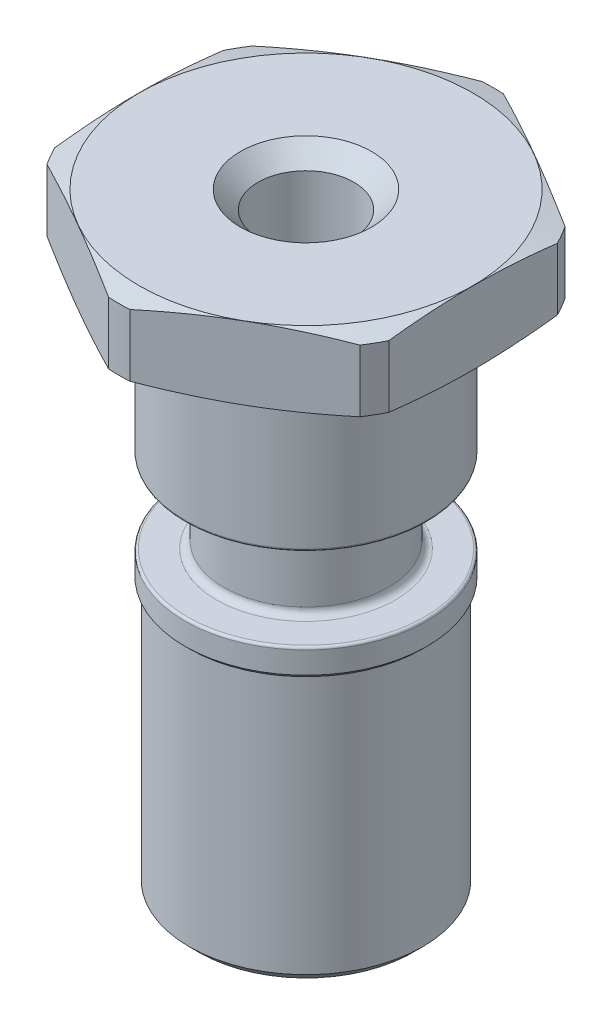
ISO-10303-21;
HEADER;
FILE_DESCRIPTION(('STEP AP214'),'2;1');
FILE_NAME('part.step','',(''),(''),'','','');
FILE_SCHEMA(('AUTOMOTIVE_DESIGN { 1 0 10303 214 1 1 1 1 }'));
ENDSEC;
DATA;
#1=APPLICATION_CONTEXT('core data for automotive mechanical design processes');
#2=APPLICATION_PROTOCOL_DEFINITION('international standard','automotive_design',2000,#1);
#3=PRODUCT_CONTEXT('',#1,'mechanical');
#4=PRODUCT('Part','Part','',(#3));
#5=PRODUCT_RELATED_PRODUCT_CATEGORY('part','',(#4));
#6=PRODUCT_DEFINITION_FORMATION('','',#4);
#7=PRODUCT_DEFINITION_CONTEXT('part definition',#1,'design');
#8=PRODUCT_DEFINITION('design','',#6,#7);
#9=PRODUCT_DEFINITION_SHAPE('','',#8);
#10=(LENGTH_UNIT() NAMED_UNIT(*) SI_UNIT(.MILLI.,.METRE.));
#11=(NAMED_UNIT(*) PLANE_ANGLE_UNIT() SI_UNIT($,.RADIAN.));
#12=(NAMED_UNIT(*) SI_UNIT($,.STERADIAN.) SOLID_ANGLE_UNIT());
#13=UNCERTAINTY_MEASURE_WITH_UNIT(LENGTH_MEASURE(1.E-05),#10,'distance_accuracy_value','');
#14=(GEOMETRIC_REPRESENTATION_CONTEXT(3) GLOBAL_UNCERTAINTY_ASSIGNED_CONTEXT((#13)) GLOBAL_UNIT_ASSIGNED_CONTEXT((#10,
#11,#12)) REPRESENTATION_CONTEXT('',''));
#15=CARTESIAN_POINT('',(0.,0.,0.));
#16=DIRECTION('',(0.,0.,1.));
#17=DIRECTION('',(1.,0.,0.));
#18=AXIS2_PLACEMENT_3D('',#15,#16,#17);
#19=CARTESIAN_POINT('',(0.,37.19,0.));
#20=DIRECTION('',(0.,1.,0.));
#21=DIRECTION('',(0.,0.,1.));
#22=AXIS2_PLACEMENT_3D('',#19,#20,#21);
#23=CONICAL_SURFACE('',#22,8.7249,1.30899693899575);
#24=CARTESIAN_POINT('',(0.,37.19,0.));
#25=DIRECTION('',(0.,1.,0.));
#26=DIRECTION('',(0.,0.,1.));
#27=AXIS2_PLACEMENT_3D('',#24,#25,#26);
#28=CIRCLE('',#27,8.7249);
#29=CARTESIAN_POINT('',(0.,37.19,8.7249));
#30=VERTEX_POINT('',#29);
#31=EDGE_CURVE('E320',#30,#30,#28,.T.);
#32=ORIENTED_EDGE('',*,*,#31,.T.);
#33=EDGE_LOOP('',(#32));
#34=FACE_BOUND('',#33,.T.);
#35=CARTESIAN_POINT('',(0.550322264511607,37.4726452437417,9.76425036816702));
#36=CARTESIAN_POINT('',(0.867378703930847,37.4284271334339,9.58119774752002));
#37=CARTESIAN_POINT('',(1.18492607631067,37.3885797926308,9.39786168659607));
#38=CARTESIAN_POINT('',(1.82092136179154,37.3189242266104,9.03066963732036));
#39=CARTESIAN_POINT('',(2.13936948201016,37.2891185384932,8.84681352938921));
#40=CARTESIAN_POINT('',(2.7756278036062,37.2409656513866,8.47946961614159));
#41=CARTESIAN_POINT('',(3.0934353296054,37.222572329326,8.29598335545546));
#42=CARTESIAN_POINT('',(3.72937026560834,37.1979409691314,7.92882614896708));
#43=CARTESIAN_POINT('',(4.04749763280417,37.1917014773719,7.74515522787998));
#44=CARTESIAN_POINT('',(4.68375236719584,37.1917014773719,7.37781338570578));
#45=CARTESIAN_POINT('',(5.00187973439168,37.1979409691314,7.19414246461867));
#46=CARTESIAN_POINT('',(5.63781467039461,37.222572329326,6.82698525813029));
#47=CARTESIAN_POINT('',(5.95562219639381,37.2409656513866,6.64349899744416));
#48=CARTESIAN_POINT('',(6.59188051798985,37.2891185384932,6.27615508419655));
#49=CARTESIAN_POINT('',(6.91032863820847,37.3189242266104,6.0922989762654));
#50=CARTESIAN_POINT('',(7.54632392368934,37.3885797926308,5.72510692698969));
#51=CARTESIAN_POINT('',(7.86387129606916,37.4284271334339,5.54177086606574));
#52=CARTESIAN_POINT('',(8.1809277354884,37.4726452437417,5.35871824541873));
#53=B_SPLINE_CURVE_WITH_KNOTS('',3,(#35,#36,#37,#38,#39,#40,#41,#42,#43,#44,#45,#46,#47,#48,#49,
#50,#51,#52),.UNSPECIFIED.,.F.,.F.,(4,2,2,2,2,2,2,2,4),(0.,1.10632965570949,2.21293862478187,
3.31504559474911,4.41702074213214,5.51899588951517,6.6211028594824,7.72771182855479,
8.83404148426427),.UNSPECIFIED.);
#54=CARTESIAN_POINT('',(0.551757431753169,37.4724452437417,9.76342177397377));
#55=VERTEX_POINT('',#54);
#56=CARTESIAN_POINT('',(8.17949256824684,37.4724452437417,5.35954683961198));
#57=VERTEX_POINT('',#56);
#58=EDGE_CURVE('E207',#55,#57,#53,.T.);
#59=ORIENTED_EDGE('',*,*,#58,.F.);
#60=CARTESIAN_POINT('',(0.,37.4724452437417,0.));
#61=DIRECTION('',(0.,1.,0.));
#62=DIRECTION('',(0.,0.,1.));
#63=AXIS2_PLACEMENT_3D('',#60,#61,#62);
#64=CIRCLE('',#63,9.779);
#65=CARTESIAN_POINT('',(-0.551757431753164,37.4724452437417,9.76342177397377));
#66=VERTEX_POINT('',#65);
#67=EDGE_CURVE('E162',#66,#55,#64,.T.);
#68=ORIENTED_EDGE('',*,*,#67,.F.);
#69=CARTESIAN_POINT('',(-8.1809277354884,37.4726452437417,5.35871824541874));
#70=CARTESIAN_POINT('',(-7.86387129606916,37.4284271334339,5.54177086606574));
#71=CARTESIAN_POINT('',(-7.54632392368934,37.3885797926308,5.72510692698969));
#72=CARTESIAN_POINT('',(-6.91032863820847,37.3189242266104,6.0922989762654));
#73=CARTESIAN_POINT('',(-6.59188051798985,37.2891185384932,6.27615508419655));
#74=CARTESIAN_POINT('',(-5.95562219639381,37.2409656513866,6.64349899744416));
#75=CARTESIAN_POINT('',(-5.63781467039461,37.222572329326,6.82698525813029));
#76=CARTESIAN_POINT('',(-5.00187973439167,37.1979409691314,7.19414246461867));
#77=CARTESIAN_POINT('',(-4.68375236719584,37.1917014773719,7.37781338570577));
#78=CARTESIAN_POINT('',(-4.04749763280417,37.1917014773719,7.74515522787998));
#79=CARTESIAN_POINT('',(-3.72937026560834,37.1979409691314,7.92882614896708));
#80=CARTESIAN_POINT('',(-3.0934353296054,37.222572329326,8.29598335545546));
#81=CARTESIAN_POINT('',(-2.7756278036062,37.2409656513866,8.47946961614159));
#82=CARTESIAN_POINT('',(-2.13936948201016,37.2891185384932,8.8468135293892));
#83=CARTESIAN_POINT('',(-1.82092136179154,37.3189242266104,9.03066963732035));
#84=CARTESIAN_POINT('',(-1.18492607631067,37.3885797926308,9.39786168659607));
#85=CARTESIAN_POINT('',(-0.867378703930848,37.4284271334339,9.58119774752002));
#86=CARTESIAN_POINT('',(-0.550322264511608,37.4726452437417,9.76425036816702));
#87=B_SPLINE_CURVE_WITH_KNOTS('',3,(#69,#70,#71,#72,#73,#74,#75,#76,#77,#78,#79,#80,#81,#82,#83,
#84,#85,#86),.UNSPECIFIED.,.F.,.F.,(4,2,2,2,2,2,2,2,4),(0.,1.10632965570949,2.21293862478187,
3.3150455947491,4.41702074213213,5.51899588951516,6.62110285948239,7.72771182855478,
8.83404148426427),.UNSPECIFIED.);
#88=CARTESIAN_POINT('',(-8.17949256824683,37.4724452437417,5.35954683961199));
#89=VERTEX_POINT('',#88);
#90=EDGE_CURVE('E307',#89,#66,#87,.T.);
#91=ORIENTED_EDGE('',*,*,#90,.F.);
#92=CARTESIAN_POINT('',(-8.73125,37.4724452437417,4.40387493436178));
#93=VERTEX_POINT('',#92);
#94=EDGE_CURVE('E167',#93,#89,#64,.T.);
#95=ORIENTED_EDGE('',*,*,#94,.F.);
#96=CARTESIAN_POINT('',(-8.73125,39.1200704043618,-13.3216785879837));
#97=CARTESIAN_POINT('',(-8.73125,39.031358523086,-12.9257205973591));
#98=CARTESIAN_POINT('',(-8.73125,38.9437338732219,-12.5295145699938));
#99=CARTESIAN_POINT('',(-8.73125,38.7712458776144,-11.7364846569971));
#100=CARTESIAN_POINT('',(-8.73125,38.6863826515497,-11.3396607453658));
#101=CARTESIAN_POINT('',(-8.73125,38.5199301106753,-10.5449159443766));
#102=CARTESIAN_POINT('',(-8.73125,38.4383441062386,-10.1469943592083));
#103=CARTESIAN_POINT('',(-8.73125,38.2793288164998,-9.35032196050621));
#104=CARTESIAN_POINT('',(-8.73125,38.2018994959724,-8.95157115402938));
#105=CARTESIAN_POINT('',(-8.73125,38.0527847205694,-8.15628119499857));
#106=CARTESIAN_POINT('',(-8.73125,37.9810584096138,-7.75974974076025));
#107=CARTESIAN_POINT('',(-8.73125,37.8438827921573,-6.96560446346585));
#108=CARTESIAN_POINT('',(-8.73125,37.7784333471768,-6.56799066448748));
#109=CARTESIAN_POINT('',(-8.73125,37.6552879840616,-5.77160510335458));
#110=CARTESIAN_POINT('',(-8.73125,37.5975910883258,-5.3728334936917));
#111=CARTESIAN_POINT('',(-8.73125,37.4916535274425,-4.57402175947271));
#112=CARTESIAN_POINT('',(-8.73125,37.4434128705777,-4.17398163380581));
#113=CARTESIAN_POINT('',(-8.73125,37.3577567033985,-3.36812507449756));
#114=CARTESIAN_POINT('',(-8.73125,37.3204705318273,-2.96229468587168));
#115=CARTESIAN_POINT('',(-8.73125,37.2592973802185,-2.14961659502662));
#116=CARTESIAN_POINT('',(-8.73125,37.2354100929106,-1.74276891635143));
#117=CARTESIAN_POINT('',(-8.73125,37.2024280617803,-0.928646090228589));
#118=CARTESIAN_POINT('',(-8.73125,37.1933266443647,-0.521371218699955));
#119=CARTESIAN_POINT('',(-8.73125,37.1904756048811,0.293233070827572));
#120=CARTESIAN_POINT('',(-8.73125,37.1967259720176,0.700562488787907));
#121=CARTESIAN_POINT('',(-8.73125,37.2242269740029,1.51618691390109));
#122=CARTESIAN_POINT('',(-8.73125,37.2455320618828,1.92448004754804));
#123=CARTESIAN_POINT('',(-8.73125,37.3019277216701,2.74010430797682));
#124=CARTESIAN_POINT('',(-8.73125,37.3370185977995,3.14743541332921));
#125=CARTESIAN_POINT('',(-8.73125,37.4192166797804,3.96113260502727));
#126=CARTESIAN_POINT('',(-8.73125,37.4663316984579,4.3674978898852));
#127=CARTESIAN_POINT('',(-8.73125,37.5706216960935,5.17892119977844));
#128=CARTESIAN_POINT('',(-8.73125,37.6277967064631,5.58397922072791));
#129=CARTESIAN_POINT('',(-8.73125,37.7462388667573,6.36549376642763));
#130=CARTESIAN_POINT('',(-8.73125,37.8069680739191,6.7420326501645));
#131=CARTESIAN_POINT('',(-8.73125,37.9343034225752,7.49412024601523));
#132=CARTESIAN_POINT('',(-8.73125,38.0009097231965,7.86966893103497));
#133=CARTESIAN_POINT('',(-8.73125,38.1389274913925,8.61991246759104));
#134=CARTESIAN_POINT('',(-8.73125,38.2103393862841,8.99460724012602));
#135=CARTESIAN_POINT('',(-8.73125,38.3570864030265,9.74322996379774));
#136=CARTESIAN_POINT('',(-8.73125,38.4324215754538,10.1171579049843));
#137=CARTESIAN_POINT('',(-8.73125,38.5863233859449,10.8644333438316));
#138=CARTESIAN_POINT('',(-8.73125,38.6648907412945,11.2377806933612));
#139=CARTESIAN_POINT('',(-8.73125,38.8246795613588,11.9839078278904));
#140=CARTESIAN_POINT('',(-8.73125,38.9059010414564,12.3566876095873));
#141=CARTESIAN_POINT('',(-8.73125,39.1528316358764,13.4742524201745));
#142=CARTESIAN_POINT('',(-8.73125,39.3218173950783,14.2183131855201));
#143=CARTESIAN_POINT('',(-8.73125,39.6641955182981,15.6977051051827));
#144=CARTESIAN_POINT('',(-8.73125,39.8375282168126,16.433050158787));
#145=CARTESIAN_POINT('',(-8.73125,40.1885391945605,17.9027146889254));
#146=CARTESIAN_POINT('',(-8.73125,40.3662175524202,18.6370341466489));
#147=CARTESIAN_POINT('',(-8.73125,40.7245623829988,20.1039869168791));
#148=CARTESIAN_POINT('',(-8.73124999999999,40.9052249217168,20.8366211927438));
#149=CARTESIAN_POINT('',(-8.73124999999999,41.2690196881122,22.3012511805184));
#150=CARTESIAN_POINT('',(-8.73125,41.4521518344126,23.0332469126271));
#151=CARTESIAN_POINT('',(-8.73125,41.6361594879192,23.7650200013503));
#152=B_SPLINE_CURVE_WITH_KNOTS('',3,(#96,#97,#98,#99,#100,#101,#102,#103,#104,#105,#106,#107,
#108,#109,#110,#111,#112,#113,#114,#115,#116,#117,#118,#119,#120,#121,#122,#123,#124,#125,#126,
#127,#128,#129,#130,#131,#132,#133,#134,#135,#136,#137,#138,#139,#140,#141,#142,#143,#144,#145,
#146,#147,#148,#149,#150,#151),.UNSPECIFIED.,.F.,.F.,(4,2,2,2,2,2,2,2,2,2,2,2,2,2,2,2,2,2,2,2,2,
2,2,2,2,2,2,4),(0.,1.2173269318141,2.43470655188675,3.65328643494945,4.87185598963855,
6.08071466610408,7.28954666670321,8.49822608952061,9.70690657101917,10.9293318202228,
12.1517290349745,13.3735743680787,14.5954188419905,15.8217055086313,17.0480192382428,
18.2751318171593,19.5022482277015,20.6464076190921,21.7905979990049,22.934890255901,
24.0791972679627,25.2237596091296,26.3683285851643,28.6573124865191,30.9237898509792,
33.1903082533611,35.4540455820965,37.7177084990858),.UNSPECIFIED.);
#153=CARTESIAN_POINT('',(-8.73125,37.4724452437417,-4.40387493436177));
#154=VERTEX_POINT('',#153);
#155=EDGE_CURVE('E760',#154,#93,#152,.T.);
#156=ORIENTED_EDGE('',*,*,#155,.F.);
#157=CARTESIAN_POINT('',(-8.17949256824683,37.4724452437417,-5.35954683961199));
#158=VERTEX_POINT('',#157);
#159=EDGE_CURVE('E712',#158,#154,#64,.T.);
#160=ORIENTED_EDGE('',*,*,#159,.F.);
#161=CARTESIAN_POINT('',(-0.55032226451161,37.4726452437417,-9.76425036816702));
#162=CARTESIAN_POINT('',(-0.867378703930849,37.4284271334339,-9.58119774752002));
#163=CARTESIAN_POINT('',(-1.18492607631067,37.3885797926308,-9.39786168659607));
#164=CARTESIAN_POINT('',(-1.82092136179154,37.3189242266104,-9.03066963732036));
#165=CARTESIAN_POINT('',(-2.13936948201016,37.2891185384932,-8.84681352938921));
#166=CARTESIAN_POINT('',(-2.7756278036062,37.2409656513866,-8.47946961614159));
#167=CARTESIAN_POINT('',(-3.0934353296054,37.222572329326,-8.29598335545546));
#168=CARTESIAN_POINT('',(-3.72937026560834,37.1979409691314,-7.92882614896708));
#169=CARTESIAN_POINT('',(-4.04749763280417,37.1917014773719,-7.74515522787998));
#170=CARTESIAN_POINT('',(-4.68375236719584,37.1917014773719,-7.37781338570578));
#171=CARTESIAN_POINT('',(-5.00187973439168,37.1979409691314,-7.19414246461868));
#172=CARTESIAN_POINT('',(-5.63781467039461,37.222572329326,-6.82698525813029));
#173=CARTESIAN_POINT('',(-5.95562219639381,37.2409656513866,-6.64349899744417));
#174=CARTESIAN_POINT('',(-6.59188051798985,37.2891185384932,-6.27615508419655));
#175=CARTESIAN_POINT('',(-6.91032863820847,37.3189242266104,-6.0922989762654));
#176=CARTESIAN_POINT('',(-7.54632392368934,37.3885797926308,-5.72510692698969));
#177=CARTESIAN_POINT('',(-7.86387129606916,37.4284271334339,-5.54177086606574));
#178=CARTESIAN_POINT('',(-8.1809277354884,37.4726452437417,-5.35871824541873));
#179=B_SPLINE_CURVE_WITH_KNOTS('',3,(#161,#162,#163,#164,#165,#166,#167,#168,#169,#170,#171,
#172,#173,#174,#175,#176,#177,#178),.UNSPECIFIED.,.F.,.F.,(4,2,2,2,2,2,2,2,4),(0.,
1.10632965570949,2.21293862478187,3.3150455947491,4.41702074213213,5.51899588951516,
6.6211028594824,7.72771182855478,8.83404148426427),.UNSPECIFIED.);
#180=CARTESIAN_POINT('',(-0.551757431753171,37.4724452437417,-9.76342177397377));
#181=VERTEX_POINT('',#180);
#182=EDGE_CURVE('E728',#181,#158,#179,.T.);
#183=ORIENTED_EDGE('',*,*,#182,.F.);
#184=CARTESIAN_POINT('',(0.551757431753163,37.4724452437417,-9.76342177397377));
#185=VERTEX_POINT('',#184);
#186=EDGE_CURVE('E326',#185,#181,#64,.T.);
#187=ORIENTED_EDGE('',*,*,#186,.F.);
#188=CARTESIAN_POINT('',(8.1809277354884,37.4726452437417,-5.35871824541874));
#189=CARTESIAN_POINT('',(7.86387129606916,37.4284271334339,-5.54177086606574));
#190=CARTESIAN_POINT('',(7.54632392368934,37.3885797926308,-5.72510692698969));
#191=CARTESIAN_POINT('',(6.91032863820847,37.3189242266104,-6.0922989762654));
#192=CARTESIAN_POINT('',(6.59188051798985,37.2891185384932,-6.27615508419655));
#193=CARTESIAN_POINT('',(5.95562219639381,37.2409656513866,-6.64349899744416));
#194=CARTESIAN_POINT('',(5.63781467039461,37.222572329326,-6.82698525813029));
#195=CARTESIAN_POINT('',(5.00187973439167,37.1979409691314,-7.19414246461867));
#196=CARTESIAN_POINT('',(4.68375236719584,37.1917014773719,-7.37781338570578));
#197=CARTESIAN_POINT('',(4.04749763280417,37.1917014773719,-7.74515522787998));
#198=CARTESIAN_POINT('',(3.72937026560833,37.1979409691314,-7.92882614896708));
#199=CARTESIAN_POINT('',(3.0934353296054,37.222572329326,-8.29598335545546));
#200=CARTESIAN_POINT('',(2.7756278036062,37.2409656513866,-8.47946961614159));
#201=CARTESIAN_POINT('',(2.13936948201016,37.2891185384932,-8.84681352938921));
#202=CARTESIAN_POINT('',(1.82092136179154,37.3189242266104,-9.03066963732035));
#203=CARTESIAN_POINT('',(1.18492607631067,37.3885797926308,-9.39786168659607));
#204=CARTESIAN_POINT('',(0.867378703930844,37.4284271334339,-9.58119774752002));
#205=CARTESIAN_POINT('',(0.550322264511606,37.4726452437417,-9.76425036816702));
#206=B_SPLINE_CURVE_WITH_KNOTS('',3,(#188,#189,#190,#191,#192,#193,#194,#195,#196,#197,#198,
#199,#200,#201,#202,#203,#204,#205),.UNSPECIFIED.,.F.,.F.,(4,2,2,2,2,2,2,2,4),(0.,
1.10632965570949,2.21293862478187,3.3150455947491,4.41702074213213,5.51899588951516,
6.62110285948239,7.72771182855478,8.83404148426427),.UNSPECIFIED.);
#207=CARTESIAN_POINT('',(8.17949256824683,37.4724452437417,-5.35954683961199));
#208=VERTEX_POINT('',#207);
#209=EDGE_CURVE('E727',#208,#185,#206,.T.);
#210=ORIENTED_EDGE('',*,*,#209,.F.);
#211=CARTESIAN_POINT('',(8.73125,37.4724452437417,-4.40387493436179));
#212=VERTEX_POINT('',#211);
#213=EDGE_CURVE('E321',#212,#208,#64,.T.);
#214=ORIENTED_EDGE('',*,*,#213,.F.);
#215=CARTESIAN_POINT('',(8.73125,39.1200692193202,-13.3216733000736));
#216=CARTESIAN_POINT('',(8.73125,39.0313573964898,-12.9257155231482));
#217=CARTESIAN_POINT('',(8.73125,38.9437328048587,-12.5295097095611));
#218=CARTESIAN_POINT('',(8.73125,38.7712449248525,-11.7364802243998));
#219=CARTESIAN_POINT('',(8.73125,38.6863817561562,-11.3396565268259));
#220=CARTESIAN_POINT('',(8.73125,38.5199293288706,-10.5449121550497));
#221=CARTESIAN_POINT('',(8.73125,38.4383433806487,-10.1469907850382));
#222=CARTESIAN_POINT('',(8.73125,38.2793282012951,-9.3503188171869));
#223=CARTESIAN_POINT('',(8.73125,38.2018989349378,-8.95156822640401));
#224=CARTESIAN_POINT('',(8.73125,38.0527842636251,-8.15627869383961));
#225=CARTESIAN_POINT('',(8.73125,37.9810580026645,-7.75974745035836));
#226=CARTESIAN_POINT('',(8.73125,37.8438824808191,-6.96560259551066));
#227=CARTESIAN_POINT('',(8.73125,37.7784330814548,-6.56798900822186));
#228=CARTESIAN_POINT('',(8.73125,37.6552878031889,-5.77160387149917));
#229=CARTESIAN_POINT('',(8.73125,37.5975909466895,-5.37283247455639));
#230=CARTESIAN_POINT('',(8.73125,37.491653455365,-4.57402116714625));
#231=CARTESIAN_POINT('',(8.73125,37.4434128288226,-4.17398125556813));
#232=CARTESIAN_POINT('',(8.73125,37.3577567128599,-3.36812514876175));
#233=CARTESIAN_POINT('',(8.73125,37.3204705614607,-2.96229499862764));
#234=CARTESIAN_POINT('',(8.73125,37.2592974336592,-2.149617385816));
#235=CARTESIAN_POINT('',(8.73125,37.2354101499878,-1.74276994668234));
#236=CARTESIAN_POINT('',(8.73125,37.2024281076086,-0.928647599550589));
#237=CARTESIAN_POINT('',(8.73125,37.1933266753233,-0.52137296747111));
#238=CARTESIAN_POINT('',(8.73125,37.1904755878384,0.29323084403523));
#239=CARTESIAN_POINT('',(8.73125,37.1967259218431,0.70056002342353));
#240=CARTESIAN_POINT('',(8.73125,37.2242268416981,1.51618397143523));
#241=CARTESIAN_POINT('',(8.73125,37.2455318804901,1.92447686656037));
#242=CARTESIAN_POINT('',(8.73125,37.3019274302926,2.74010065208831));
#243=CARTESIAN_POINT('',(8.73125,37.337018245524,3.14743152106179));
#244=CARTESIAN_POINT('',(8.73125,37.419216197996,3.96112824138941));
#245=CARTESIAN_POINT('',(8.73125,37.4663311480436,4.36749329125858));
#246=CARTESIAN_POINT('',(8.73125,37.5706210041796,5.17891613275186));
#247=CARTESIAN_POINT('',(8.73125,37.6277959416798,5.58397392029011));
#248=CARTESIAN_POINT('',(8.73125,37.7462379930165,6.36548823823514));
#249=CARTESIAN_POINT('',(8.73125,37.8069671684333,6.74202712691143));
#250=CARTESIAN_POINT('',(8.73125,37.9343024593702,7.49411473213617));
#251=CARTESIAN_POINT('',(8.73125,38.0009087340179,7.86966342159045));
#252=CARTESIAN_POINT('',(8.73125,38.1389264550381,8.61990696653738));
#253=CARTESIAN_POINT('',(8.73125,38.210338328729,8.99460174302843));
#254=CARTESIAN_POINT('',(8.73125,38.3570853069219,9.74322447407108));
#255=CARTESIAN_POINT('',(8.73125,38.4324204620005,10.1171524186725));
#256=CARTESIAN_POINT('',(8.73125,38.5863222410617,10.8644278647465));
#257=CARTESIAN_POINT('',(8.73125,38.6648895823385,11.2377752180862));
#258=CARTESIAN_POINT('',(8.73125,38.8246783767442,11.9839023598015));
#259=CARTESIAN_POINT('',(8.73125,38.9058998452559,12.3566821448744));
#260=CARTESIAN_POINT('',(8.73125,39.1528304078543,13.4742469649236));
#261=CARTESIAN_POINT('',(8.73125,39.3218161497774,14.2183077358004));
#262=CARTESIAN_POINT('',(8.73125,39.6641942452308,15.6976996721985));
#263=CARTESIAN_POINT('',(8.73125,39.8375269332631,16.4330447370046));
#264=CARTESIAN_POINT('',(8.73125,40.1885378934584,17.9027092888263));
#265=CARTESIAN_POINT('',(8.73125,40.3662162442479,18.6370287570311));
#266=CARTESIAN_POINT('',(8.73125,40.7245610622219,20.1039815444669));
#267=CARTESIAN_POINT('',(8.73125,40.9052235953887,20.83661582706));
#268=CARTESIAN_POINT('',(8.73125,41.269018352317,22.3012458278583));
#269=CARTESIAN_POINT('',(8.73125,41.4521504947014,23.0332415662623));
#270=CARTESIAN_POINT('',(8.73125,41.6361581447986,23.7650146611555));
#271=B_SPLINE_CURVE_WITH_KNOTS('',3,(#215,#216,#217,#218,#219,#220,#221,#222,#223,#224,#225,
#226,#227,#228,#229,#230,#231,#232,#233,#234,#235,#236,#237,#238,#239,#240,#241,#242,#243,#244,
#245,#246,#247,#248,#249,#250,#251,#252,#253,#254,#255,#256,#257,#258,#259,#260,#261,#262,#263,
#264,#265,#266,#267,#268,#269,#270),.UNSPECIFIED.,.F.,.F.,(4,2,2,2,2,2,2,2,2,2,2,2,2,2,2,2,2,2,
2,2,2,2,2,2,2,2,2,4),(0.,1.21732626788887,2.4347052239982,3.65328444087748,4.87185332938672,
6.08071135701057,7.28954270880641,8.49822148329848,9.70690131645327,10.9293258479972,
12.1517223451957,13.373566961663,14.5954107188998,15.82169666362,17.0480096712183,
18.2751215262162,19.5022372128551,20.6463966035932,21.7905869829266,22.9348792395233,
24.0791862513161,25.2237485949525,26.3683175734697,28.6573014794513,30.9237788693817,
33.1902972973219,35.4540346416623,37.7176975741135),.UNSPECIFIED.);
#272=CARTESIAN_POINT('',(8.73125,37.4724452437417,4.40387493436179));
#273=VERTEX_POINT('',#272);
#274=EDGE_CURVE('E319',#273,#212,#271,.F.);
#275=ORIENTED_EDGE('',*,*,#274,.F.);
#276=EDGE_CURVE('E157',#57,#273,#64,.T.);
#277=ORIENTED_EDGE('',*,*,#276,.F.);
#278=EDGE_LOOP('',(#59,#68,#91,#95,#156,#160,#183,#187,#210,#214,#275,#277));
#279=FACE_BOUND('',#278,.T.);
#280=ADVANCED_FACE('F38',(#34,#279),#23,.T.);
#281=CARTESIAN_POINT('',(0.,86.36,0.));
#282=DIRECTION('',(0.,1.,0.));
#283=DIRECTION('',(0.,0.,1.));
#284=AXIS2_PLACEMENT_3D('',#281,#282,#283);
#285=CYLINDRICAL_SURFACE('',#284,9.779);
#286=DIRECTION('',(0.,1.,0.));
#287=VECTOR('',#286,1.);
#288=CARTESIAN_POINT('',(8.17949256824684,86.36,5.35954683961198));
#289=LINE('',#288,#287);
#290=CARTESIAN_POINT('',(8.17949256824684,40.7175547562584,5.35954683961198));
#291=VERTEX_POINT('',#290);
#292=EDGE_CURVE('E213',#57,#291,#289,.T.);
#293=ORIENTED_EDGE('',*,*,#292,.F.);
#294=ORIENTED_EDGE('',*,*,#276,.T.);
#295=DIRECTION('',(0.,1.,0.));
#296=VECTOR('',#295,1.);
#297=CARTESIAN_POINT('',(8.73125,86.36,4.40387493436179));
#298=LINE('',#297,#296);
#299=CARTESIAN_POINT('',(8.73125,40.7175547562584,4.4038749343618));
#300=VERTEX_POINT('',#299);
#301=EDGE_CURVE('E139',#300,#273,#298,.F.);
#302=ORIENTED_EDGE('',*,*,#301,.F.);
#303=CARTESIAN_POINT('',(0.,40.7175547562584,0.));
#304=DIRECTION('',(0.,1.,0.));
#305=DIRECTION('',(0.,0.,1.));
#306=AXIS2_PLACEMENT_3D('',#303,#304,#305);
#307=CIRCLE('',#306,9.779);
#308=EDGE_CURVE('E155',#291,#300,#307,.T.);
#309=ORIENTED_EDGE('',*,*,#308,.F.);
#310=EDGE_LOOP('',(#293,#294,#302,#309));
#311=FACE_BOUND('',#310,.T.);
#312=ADVANCED_FACE('F154',(#311),#285,.T.);
#313=DIRECTION('',(0.,1.,0.));
#314=VECTOR('',#313,1.);
#315=CARTESIAN_POINT('',(0.551757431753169,86.36,9.76342177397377));
#316=LINE('',#315,#314);
#317=CARTESIAN_POINT('',(0.551757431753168,40.7175547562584,9.76342177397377));
#318=VERTEX_POINT('',#317);
#319=EDGE_CURVE('E312',#318,#55,#316,.F.);
#320=ORIENTED_EDGE('',*,*,#319,.F.);
#321=CARTESIAN_POINT('',(-0.551757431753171,40.7175547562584,9.76342177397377));
#322=VERTEX_POINT('',#321);
#323=EDGE_CURVE('E165',#322,#318,#307,.T.);
#324=ORIENTED_EDGE('',*,*,#323,.F.);
#325=DIRECTION('',(0.,1.,0.));
#326=VECTOR('',#325,1.);
#327=CARTESIAN_POINT('',(-0.551757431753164,86.36,9.76342177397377));
#328=LINE('',#327,#326);
#329=EDGE_CURVE('E58',#66,#322,#328,.T.);
#330=ORIENTED_EDGE('',*,*,#329,.F.);
#331=ORIENTED_EDGE('',*,*,#67,.T.);
#332=EDGE_LOOP('',(#320,#324,#330,#331));
#333=FACE_BOUND('',#332,.T.);
#334=ADVANCED_FACE('F389',(#333),#285,.T.);
#335=DIRECTION('',(0.,1.,0.));
#336=VECTOR('',#335,1.);
#337=CARTESIAN_POINT('',(-8.17949256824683,86.36,5.35954683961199));
#338=LINE('',#337,#336);
#339=CARTESIAN_POINT('',(-8.17949256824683,40.7175547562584,5.35954683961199));
#340=VERTEX_POINT('',#339);
#341=EDGE_CURVE('E711',#340,#89,#338,.F.);
#342=ORIENTED_EDGE('',*,*,#341,.F.);
#343=CARTESIAN_POINT('',(-8.73125,40.7175547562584,4.40387493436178));
#344=VERTEX_POINT('',#343);
#345=EDGE_CURVE('E171',#344,#340,#307,.T.);
#346=ORIENTED_EDGE('',*,*,#345,.F.);
#347=DIRECTION('',(0.,1.,0.));
#348=VECTOR('',#347,1.);
#349=CARTESIAN_POINT('',(-8.73125,86.36,4.40387493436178));
#350=LINE('',#349,#348);
#351=EDGE_CURVE('E66',#93,#344,#350,.T.);
#352=ORIENTED_EDGE('',*,*,#351,.F.);
#353=ORIENTED_EDGE('',*,*,#94,.T.);
#354=EDGE_LOOP('',(#342,#346,#352,#353));
#355=FACE_BOUND('',#354,.T.);
#356=ADVANCED_FACE('F673',(#355),#285,.T.);
#357=DIRECTION('',(0.,1.,0.));
#358=VECTOR('',#357,1.);
#359=CARTESIAN_POINT('',(-8.73125,86.36,-4.40387493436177));
#360=LINE('',#359,#358);
#361=CARTESIAN_POINT('',(-8.73125,40.7175547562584,-4.40387493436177));
#362=VERTEX_POINT('',#361);
#363=EDGE_CURVE('E729',#362,#154,#360,.F.);
#364=ORIENTED_EDGE('',*,*,#363,.F.);
#365=CARTESIAN_POINT('',(-8.17949256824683,40.7175547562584,-5.35954683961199));
#366=VERTEX_POINT('',#365);
#367=EDGE_CURVE('E175',#366,#362,#307,.T.);
#368=ORIENTED_EDGE('',*,*,#367,.F.);
#369=DIRECTION('',(0.,1.,0.));
#370=VECTOR('',#369,1.);
#371=CARTESIAN_POINT('',(-8.17949256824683,86.36,-5.35954683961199));
#372=LINE('',#371,#370);
#373=EDGE_CURVE('E730',#158,#366,#372,.T.);
#374=ORIENTED_EDGE('',*,*,#373,.F.);
#375=ORIENTED_EDGE('',*,*,#159,.T.);
#376=EDGE_LOOP('',(#364,#368,#374,#375));
#377=FACE_BOUND('',#376,.T.);
#378=ADVANCED_FACE('F665',(#377),#285,.T.);
#379=DIRECTION('',(0.,1.,0.));
#380=VECTOR('',#379,1.);
#381=CARTESIAN_POINT('',(-0.551757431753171,86.36,-9.76342177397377));
#382=LINE('',#381,#380);
#383=CARTESIAN_POINT('',(-0.551757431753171,40.7175547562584,-9.76342177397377));
#384=VERTEX_POINT('',#383);
#385=EDGE_CURVE('E722',#384,#181,#382,.F.);
#386=ORIENTED_EDGE('',*,*,#385,.F.);
#387=CARTESIAN_POINT('',(0.551757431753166,40.7175547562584,-9.76342177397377));
#388=VERTEX_POINT('',#387);
#389=EDGE_CURVE('E169',#388,#384,#307,.T.);
#390=ORIENTED_EDGE('',*,*,#389,.F.);
#391=DIRECTION('',(0.,1.,0.));
#392=VECTOR('',#391,1.);
#393=CARTESIAN_POINT('',(0.551757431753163,86.36,-9.76342177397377));
#394=LINE('',#393,#392);
#395=EDGE_CURVE('E724',#185,#388,#394,.T.);
#396=ORIENTED_EDGE('',*,*,#395,.F.);
#397=ORIENTED_EDGE('',*,*,#186,.T.);
#398=EDGE_LOOP('',(#386,#390,#396,#397));
#399=FACE_BOUND('',#398,.T.);
#400=ADVANCED_FACE('F657',(#399),#285,.T.);
#401=DIRECTION('',(0.,1.,0.));
#402=VECTOR('',#401,1.);
#403=CARTESIAN_POINT('',(8.17949256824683,86.36,-5.35954683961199));
#404=LINE('',#403,#402);
#405=CARTESIAN_POINT('',(8.17949256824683,40.7175547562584,-5.35954683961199));
#406=VERTEX_POINT('',#405);
#407=EDGE_CURVE('E754',#406,#208,#404,.F.);
#408=ORIENTED_EDGE('',*,*,#407,.F.);
#409=CARTESIAN_POINT('',(8.73125,40.7175547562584,-4.40387493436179));
#410=VERTEX_POINT('',#409);
#411=EDGE_CURVE('E163',#410,#406,#307,.T.);
#412=ORIENTED_EDGE('',*,*,#411,.F.);
#413=DIRECTION('',(0.,1.,0.));
#414=VECTOR('',#413,1.);
#415=CARTESIAN_POINT('',(8.73125,86.36,-4.40387493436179));
#416=LINE('',#415,#414);
#417=EDGE_CURVE('E142',#212,#410,#416,.T.);
#418=ORIENTED_EDGE('',*,*,#417,.F.);
#419=ORIENTED_EDGE('',*,*,#213,.T.);
#420=EDGE_LOOP('',(#408,#412,#418,#419));
#421=FACE_BOUND('',#420,.T.);
#422=ADVANCED_FACE('F270',(#421),#285,.T.);
#423=CARTESIAN_POINT('',(0.,40.7175547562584,0.));
#424=DIRECTION('',(0.,-1.,0.));
#425=DIRECTION('',(0.,0.,-1.));
#426=AXIS2_PLACEMENT_3D('',#423,#424,#425);
#427=CONICAL_SURFACE('',#426,9.779,1.30899693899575);
#428=CARTESIAN_POINT('',(0.,41.,0.));
#429=DIRECTION('',(0.,1.,0.));
#430=DIRECTION('',(0.,0.,1.));
#431=AXIS2_PLACEMENT_3D('',#428,#429,#430);
#432=CIRCLE('',#431,8.7249);
#433=CARTESIAN_POINT('',(0.,41.,8.7249));
#434=VERTEX_POINT('',#433);
#435=EDGE_CURVE('E172',#434,#434,#432,.T.);
#436=ORIENTED_EDGE('',*,*,#435,.F.);
#437=EDGE_LOOP('',(#436));
#438=FACE_BOUND('',#437,.T.);
#439=CARTESIAN_POINT('',(8.18092773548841,40.7173547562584,5.35871824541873));
#440=CARTESIAN_POINT('',(7.86387129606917,40.7615728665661,5.54177086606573));
#441=CARTESIAN_POINT('',(7.54632392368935,40.8014202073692,5.72510692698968));
#442=CARTESIAN_POINT('',(6.91032863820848,40.8710757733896,6.0922989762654));
#443=CARTESIAN_POINT('',(6.59188051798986,40.9008814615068,6.27615508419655));
#444=CARTESIAN_POINT('',(5.95562219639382,40.9490343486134,6.64349899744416));
#445=CARTESIAN_POINT('',(5.63781467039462,40.967427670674,6.82698525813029));
#446=CARTESIAN_POINT('',(5.00187973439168,40.9920590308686,7.19414246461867));
#447=CARTESIAN_POINT('',(4.68375236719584,40.9982985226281,7.37781338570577));
#448=CARTESIAN_POINT('',(4.04749763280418,40.9982985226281,7.74515522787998));
#449=CARTESIAN_POINT('',(3.72937026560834,40.9920590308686,7.92882614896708));
#450=CARTESIAN_POINT('',(3.0934353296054,40.967427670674,8.29598335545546));
#451=CARTESIAN_POINT('',(2.7756278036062,40.9490343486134,8.47946961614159));
#452=CARTESIAN_POINT('',(2.13936948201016,40.9008814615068,8.84681352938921));
#453=CARTESIAN_POINT('',(1.82092136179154,40.8710757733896,9.03066963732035));
#454=CARTESIAN_POINT('',(1.18492607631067,40.8014202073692,9.39786168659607));
#455=CARTESIAN_POINT('',(0.867378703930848,40.7615728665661,9.58119774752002));
#456=CARTESIAN_POINT('',(0.550322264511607,40.7173547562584,9.76425036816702));
#457=B_SPLINE_CURVE_WITH_KNOTS('',3,(#439,#440,#441,#442,#443,#444,#445,#446,#447,#448,#449,
#450,#451,#452,#453,#454,#455,#456),.UNSPECIFIED.,.F.,.F.,(4,2,2,2,2,2,2,2,4),(0.,
1.10632965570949,2.21293862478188,3.31504559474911,4.41702074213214,5.51899588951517,
6.6211028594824,7.72771182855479,8.83404148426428),.UNSPECIFIED.);
#458=EDGE_CURVE('E11',#291,#318,#457,.T.);
#459=ORIENTED_EDGE('',*,*,#458,.F.);
#460=ORIENTED_EDGE('',*,*,#308,.T.);
#461=CARTESIAN_POINT('',(8.73125,39.0699307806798,-13.3216733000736));
#462=CARTESIAN_POINT('',(8.73125,39.1586426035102,-12.9257155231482));
#463=CARTESIAN_POINT('',(8.73125,39.2462671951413,-12.5295097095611));
#464=CARTESIAN_POINT('',(8.73125,39.4187550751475,-11.7364802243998));
#465=CARTESIAN_POINT('',(8.73125,39.5036182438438,-11.3396565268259));
#466=CARTESIAN_POINT('',(8.73125,39.6700706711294,-10.5449121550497));
#467=CARTESIAN_POINT('',(8.73125,39.7516566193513,-10.1469907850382));
#468=CARTESIAN_POINT('',(8.73125,39.9106717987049,-9.3503188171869));
#469=CARTESIAN_POINT('',(8.73125,39.9881010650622,-8.95156822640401));
#470=CARTESIAN_POINT('',(8.73125,40.1372157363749,-8.15627869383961));
#471=CARTESIAN_POINT('',(8.73125,40.2089419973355,-7.75974745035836));
#472=CARTESIAN_POINT('',(8.73125,40.3461175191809,-6.96560259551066));
#473=CARTESIAN_POINT('',(8.73125,40.4115669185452,-6.56798900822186));
#474=CARTESIAN_POINT('',(8.73125,40.5347121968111,-5.77160387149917));
#475=CARTESIAN_POINT('',(8.73125,40.5924090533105,-5.37283247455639));
#476=CARTESIAN_POINT('',(8.73125,40.698346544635,-4.57402116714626));
#477=CARTESIAN_POINT('',(8.73125,40.7465871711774,-4.17398125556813));
#478=CARTESIAN_POINT('',(8.73125,40.8322432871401,-3.36812514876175));
#479=CARTESIAN_POINT('',(8.73125,40.8695294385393,-2.96229499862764));
#480=CARTESIAN_POINT('',(8.73125,40.9307025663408,-2.149617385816));
#481=CARTESIAN_POINT('',(8.73125,40.9545898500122,-1.74276994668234));
#482=CARTESIAN_POINT('',(8.73125,40.9875718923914,-0.928647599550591));
#483=CARTESIAN_POINT('',(8.73125,40.9966733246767,-0.521372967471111));
#484=CARTESIAN_POINT('',(8.73125,40.9995244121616,0.293230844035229));
#485=CARTESIAN_POINT('',(8.73125,40.9932740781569,0.700560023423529));
#486=CARTESIAN_POINT('',(8.73125,40.9657731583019,1.51618397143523));
#487=CARTESIAN_POINT('',(8.73125,40.9444681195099,1.92447686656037));
#488=CARTESIAN_POINT('',(8.73125,40.8880725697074,2.7401006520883));
#489=CARTESIAN_POINT('',(8.73125,40.852981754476,3.14743152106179));
#490=CARTESIAN_POINT('',(8.73125,40.770783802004,3.96112824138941));
#491=CARTESIAN_POINT('',(8.73125,40.7236688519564,4.36749329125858));
#492=CARTESIAN_POINT('',(8.73125,40.6193789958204,5.17891613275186));
#493=CARTESIAN_POINT('',(8.73125,40.5622040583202,5.58397392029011));
#494=CARTESIAN_POINT('',(8.73125,40.4437620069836,6.36548823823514));
#495=CARTESIAN_POINT('',(8.73125,40.3830328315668,6.74202712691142));
#496=CARTESIAN_POINT('',(8.73125,40.2556975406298,7.49411473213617));
#497=CARTESIAN_POINT('',(8.73125,40.1890912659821,7.86966342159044));
#498=CARTESIAN_POINT('',(8.73125,40.0510735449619,8.61990696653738));
#499=CARTESIAN_POINT('',(8.73125,39.979661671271,8.99460174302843));
#500=CARTESIAN_POINT('',(8.73125,39.8329146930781,9.74322447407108));
#501=CARTESIAN_POINT('',(8.73125,39.7575795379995,10.1171524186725));
#502=CARTESIAN_POINT('',(8.73125,39.6036777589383,10.8644278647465));
#503=CARTESIAN_POINT('',(8.73125,39.5251104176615,11.2377752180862));
#504=CARTESIAN_POINT('',(8.73125,39.3653216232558,11.9839023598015));
#505=CARTESIAN_POINT('',(8.73125,39.2841001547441,12.3566821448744));
#506=CARTESIAN_POINT('',(8.73125,39.0371695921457,13.4742469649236));
#507=CARTESIAN_POINT('',(8.73125,38.8681838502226,14.2183077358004));
#508=CARTESIAN_POINT('',(8.73125,38.5258057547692,15.6976996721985));
#509=CARTESIAN_POINT('',(8.73125,38.3524730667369,16.4330447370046));
#510=CARTESIAN_POINT('',(8.73125,38.0014621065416,17.9027092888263));
#511=CARTESIAN_POINT('',(8.73125,37.8237837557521,18.6370287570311));
#512=CARTESIAN_POINT('',(8.73125,37.4654389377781,20.1039815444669));
#513=CARTESIAN_POINT('',(8.73125,37.2847764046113,20.83661582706));
#514=CARTESIAN_POINT('',(8.73125,36.920981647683,22.3012458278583));
#515=CARTESIAN_POINT('',(8.73125,36.7378495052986,23.0332415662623));
#516=CARTESIAN_POINT('',(8.73125,36.5538418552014,23.7650146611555));
#517=B_SPLINE_CURVE_WITH_KNOTS('',3,(#461,#462,#463,#464,#465,#466,#467,#468,#469,#470,#471,
#472,#473,#474,#475,#476,#477,#478,#479,#480,#481,#482,#483,#484,#485,#486,#487,#488,#489,#490,
#491,#492,#493,#494,#495,#496,#497,#498,#499,#500,#501,#502,#503,#504,#505,#506,#507,#508,#509,
#510,#511,#512,#513,#514,#515,#516),.UNSPECIFIED.,.F.,.F.,(4,2,2,2,2,2,2,2,2,2,2,2,2,2,2,2,2,2,
2,2,2,2,2,2,2,2,2,4),(0.,1.21732626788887,2.4347052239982,3.65328444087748,4.87185332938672,
6.08071135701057,7.28954270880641,8.49822148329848,9.70690131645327,10.9293258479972,
12.1517223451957,13.373566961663,14.5954107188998,15.82169666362,17.0480096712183,
18.2751215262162,19.5022372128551,20.6463966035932,21.7905869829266,22.9348792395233,
24.0791862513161,25.2237485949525,26.3683175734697,28.6573014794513,30.9237788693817,
33.1902972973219,35.4540346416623,37.7176975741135),.UNSPECIFIED.);
#518=EDGE_CURVE('E136',#410,#300,#517,.T.);
#519=ORIENTED_EDGE('',*,*,#518,.F.);
#520=ORIENTED_EDGE('',*,*,#411,.T.);
#521=CARTESIAN_POINT('',(0.550322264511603,40.7173547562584,-9.76425036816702));
#522=CARTESIAN_POINT('',(0.867378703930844,40.7615728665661,-9.58119774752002));
#523=CARTESIAN_POINT('',(1.18492607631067,40.8014202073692,-9.39786168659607));
#524=CARTESIAN_POINT('',(1.82092136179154,40.8710757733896,-9.03066963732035));
#525=CARTESIAN_POINT('',(2.13936948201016,40.9008814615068,-8.84681352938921));
#526=CARTESIAN_POINT('',(2.7756278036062,40.9490343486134,-8.47946961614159));
#527=CARTESIAN_POINT('',(3.0934353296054,40.967427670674,-8.29598335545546));
#528=CARTESIAN_POINT('',(3.72937026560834,40.9920590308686,-7.92882614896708));
#529=CARTESIAN_POINT('',(4.04749763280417,40.9982985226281,-7.74515522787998));
#530=CARTESIAN_POINT('',(4.68375236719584,40.9982985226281,-7.37781338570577));
#531=CARTESIAN_POINT('',(5.00187973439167,40.9920590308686,-7.19414246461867));
#532=CARTESIAN_POINT('',(5.63781467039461,40.967427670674,-6.82698525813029));
#533=CARTESIAN_POINT('',(5.95562219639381,40.9490343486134,-6.64349899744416));
#534=CARTESIAN_POINT('',(6.59188051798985,40.9008814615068,-6.27615508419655));
#535=CARTESIAN_POINT('',(6.91032863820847,40.8710757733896,-6.0922989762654));
#536=CARTESIAN_POINT('',(7.54632392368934,40.8014202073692,-5.72510692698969));
#537=CARTESIAN_POINT('',(7.86387129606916,40.7615728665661,-5.54177086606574));
#538=CARTESIAN_POINT('',(8.1809277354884,40.7173547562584,-5.35871824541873));
#539=B_SPLINE_CURVE_WITH_KNOTS('',3,(#521,#522,#523,#524,#525,#526,#527,#528,#529,#530,#531,
#532,#533,#534,#535,#536,#537,#538),.UNSPECIFIED.,.F.,.F.,(4,2,2,2,2,2,2,2,4),(0.,
1.10632965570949,2.21293862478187,3.31504559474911,4.41702074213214,5.51899588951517,
6.6211028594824,7.72771182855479,8.83404148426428),.UNSPECIFIED.);
#540=EDGE_CURVE('E147',#388,#406,#539,.T.);
#541=ORIENTED_EDGE('',*,*,#540,.F.);
#542=ORIENTED_EDGE('',*,*,#389,.T.);
#543=CARTESIAN_POINT('',(-8.1809277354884,40.7173547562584,-5.35871824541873));
#544=CARTESIAN_POINT('',(-7.86387129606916,40.7615728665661,-5.54177086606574));
#545=CARTESIAN_POINT('',(-7.54632392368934,40.8014202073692,-5.72510692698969));
#546=CARTESIAN_POINT('',(-6.91032863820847,40.8710757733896,-6.0922989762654));
#547=CARTESIAN_POINT('',(-6.59188051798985,40.9008814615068,-6.27615508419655));
#548=CARTESIAN_POINT('',(-5.95562219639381,40.9490343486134,-6.64349899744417));
#549=CARTESIAN_POINT('',(-5.63781467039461,40.967427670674,-6.82698525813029));
#550=CARTESIAN_POINT('',(-5.00187973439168,40.9920590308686,-7.19414246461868));
#551=CARTESIAN_POINT('',(-4.68375236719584,40.9982985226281,-7.37781338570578));
#552=CARTESIAN_POINT('',(-4.04749763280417,40.9982985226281,-7.74515522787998));
#553=CARTESIAN_POINT('',(-3.72937026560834,40.9920590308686,-7.92882614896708));
#554=CARTESIAN_POINT('',(-3.0934353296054,40.967427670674,-8.29598335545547));
#555=CARTESIAN_POINT('',(-2.7756278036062,40.9490343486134,-8.47946961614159));
#556=CARTESIAN_POINT('',(-2.13936948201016,40.9008814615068,-8.84681352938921));
#557=CARTESIAN_POINT('',(-1.82092136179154,40.8710757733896,-9.03066963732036));
#558=CARTESIAN_POINT('',(-1.18492607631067,40.8014202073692,-9.39786168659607));
#559=CARTESIAN_POINT('',(-0.867378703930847,40.7615728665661,-9.58119774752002));
#560=CARTESIAN_POINT('',(-0.550322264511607,40.7173547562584,-9.76425036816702));
#561=B_SPLINE_CURVE_WITH_KNOTS('',3,(#543,#544,#545,#546,#547,#548,#549,#550,#551,#552,#553,
#554,#555,#556,#557,#558,#559,#560),.UNSPECIFIED.,.F.,.F.,(4,2,2,2,2,2,2,2,4),(0.,
1.10632965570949,2.21293862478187,3.3150455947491,4.41702074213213,5.51899588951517,
6.6211028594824,7.72771182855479,8.83404148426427),.UNSPECIFIED.);
#562=EDGE_CURVE('E286',#366,#384,#561,.T.);
#563=ORIENTED_EDGE('',*,*,#562,.F.);
#564=ORIENTED_EDGE('',*,*,#367,.T.);
#565=CARTESIAN_POINT('',(-8.73125,39.0699295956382,-13.3216785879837));
#566=CARTESIAN_POINT('',(-8.73125,39.158641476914,-12.9257205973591));
#567=CARTESIAN_POINT('',(-8.73125,39.2462661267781,-12.5295145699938));
#568=CARTESIAN_POINT('',(-8.73125,39.4187541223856,-11.7364846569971));
#569=CARTESIAN_POINT('',(-8.73125,39.5036173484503,-11.3396607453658));
#570=CARTESIAN_POINT('',(-8.73125,39.6700698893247,-10.5449159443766));
#571=CARTESIAN_POINT('',(-8.73125,39.7516558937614,-10.1469943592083));
#572=CARTESIAN_POINT('',(-8.73125,39.9106711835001,-9.35032196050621));
#573=CARTESIAN_POINT('',(-8.73125,39.9881005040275,-8.95157115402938));
#574=CARTESIAN_POINT('',(-8.73125,40.1372152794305,-8.15628119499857));
#575=CARTESIAN_POINT('',(-8.73125,40.2089415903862,-7.75974974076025));
#576=CARTESIAN_POINT('',(-8.73125,40.3461172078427,-6.96560446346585));
#577=CARTESIAN_POINT('',(-8.73125,40.4115666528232,-6.56799066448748));
#578=CARTESIAN_POINT('',(-8.73125,40.5347120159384,-5.77160510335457));
#579=CARTESIAN_POINT('',(-8.73125,40.5924089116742,-5.3728334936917));
#580=CARTESIAN_POINT('',(-8.73125,40.6983464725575,-4.57402175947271));
#581=CARTESIAN_POINT('',(-8.73125,40.7465871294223,-4.17398163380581));
#582=CARTESIAN_POINT('',(-8.73125,40.8322432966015,-3.36812507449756));
#583=CARTESIAN_POINT('',(-8.73125,40.8695294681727,-2.96229468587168));
#584=CARTESIAN_POINT('',(-8.73125,40.9307026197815,-2.14961659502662));
#585=CARTESIAN_POINT('',(-8.73125,40.9545899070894,-1.74276891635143));
#586=CARTESIAN_POINT('',(-8.73125,40.9875719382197,-0.928646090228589));
#587=CARTESIAN_POINT('',(-8.73125,40.9966733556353,-0.521371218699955));
#588=CARTESIAN_POINT('',(-8.73125,40.9995243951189,0.293233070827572));
#589=CARTESIAN_POINT('',(-8.73125,40.9932740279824,0.700562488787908));
#590=CARTESIAN_POINT('',(-8.73125,40.9657730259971,1.51618691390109));
#591=CARTESIAN_POINT('',(-8.73125,40.9444679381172,1.92448004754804));
#592=CARTESIAN_POINT('',(-8.73125,40.8880722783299,2.74010430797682));
#593=CARTESIAN_POINT('',(-8.73125,40.8529814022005,3.14743541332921));
#594=CARTESIAN_POINT('',(-8.73125,40.7707833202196,3.96113260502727));
#595=CARTESIAN_POINT('',(-8.73125,40.7236683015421,4.3674978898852));
#596=CARTESIAN_POINT('',(-8.73125,40.6193783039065,5.17892119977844));
#597=CARTESIAN_POINT('',(-8.73125,40.5622032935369,5.58397922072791));
#598=CARTESIAN_POINT('',(-8.73125,40.4437611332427,6.36549376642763));
#599=CARTESIAN_POINT('',(-8.73125,40.3830319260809,6.7420326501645));
#600=CARTESIAN_POINT('',(-8.73125,40.2556965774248,7.49412024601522));
#601=CARTESIAN_POINT('',(-8.73125,40.1890902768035,7.86966893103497));
#602=CARTESIAN_POINT('',(-8.73125,40.0510725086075,8.61991246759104));
#603=CARTESIAN_POINT('',(-8.73125,39.9796606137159,8.99460724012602));
#604=CARTESIAN_POINT('',(-8.73125,39.8329135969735,9.74322996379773));
#605=CARTESIAN_POINT('',(-8.73125,39.7575784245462,10.1171579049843));
#606=CARTESIAN_POINT('',(-8.73125,39.6036766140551,10.8644333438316));
#607=CARTESIAN_POINT('',(-8.73125,39.5251092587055,11.2377806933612));
#608=CARTESIAN_POINT('',(-8.73125,39.3653204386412,11.9839078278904));
#609=CARTESIAN_POINT('',(-8.73125,39.2840989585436,12.3566876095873));
#610=CARTESIAN_POINT('',(-8.73125,39.0371683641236,13.4742524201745));
#611=CARTESIAN_POINT('',(-8.73125,38.8681826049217,14.21831318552));
#612=CARTESIAN_POINT('',(-8.73125,38.5258044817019,15.6977051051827));
#613=CARTESIAN_POINT('',(-8.73125,38.3524717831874,16.433050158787));
#614=CARTESIAN_POINT('',(-8.73125,38.0014608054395,17.9027146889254));
#615=CARTESIAN_POINT('',(-8.73125,37.8237824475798,18.6370341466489));
#616=CARTESIAN_POINT('',(-8.73125,37.4654376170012,20.1039869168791));
#617=CARTESIAN_POINT('',(-8.73124999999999,37.2847750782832,20.8366211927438));
#618=CARTESIAN_POINT('',(-8.73124999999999,36.9209803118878,22.3012511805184));
#619=CARTESIAN_POINT('',(-8.73125,36.7378481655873,23.0332469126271));
#620=CARTESIAN_POINT('',(-8.73125,36.5538405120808,23.7650200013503));
#621=B_SPLINE_CURVE_WITH_KNOTS('',3,(#565,#566,#567,#568,#569,#570,#571,#572,#573,#574,#575,
#576,#577,#578,#579,#580,#581,#582,#583,#584,#585,#586,#587,#588,#589,#590,#591,#592,#593,#594,
#595,#596,#597,#598,#599,#600,#601,#602,#603,#604,#605,#606,#607,#608,#609,#610,#611,#612,#613,
#614,#615,#616,#617,#618,#619,#620),.UNSPECIFIED.,.F.,.F.,(4,2,2,2,2,2,2,2,2,2,2,2,2,2,2,2,2,2,
2,2,2,2,2,2,2,2,2,4),(0.,1.2173269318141,2.43470655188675,3.65328643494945,4.87185598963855,
6.08071466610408,7.28954666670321,8.49822608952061,9.70690657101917,10.9293318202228,
12.1517290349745,13.3735743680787,14.5954188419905,15.8217055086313,17.0480192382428,
18.2751318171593,19.5022482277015,20.646407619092,21.7905979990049,22.934890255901,
24.0791972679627,25.2237596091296,26.3683285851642,28.6573124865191,30.9237898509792,
33.1903082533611,35.4540455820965,37.7177084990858),.UNSPECIFIED.);
#622=EDGE_CURVE('E292',#344,#362,#621,.F.);
#623=ORIENTED_EDGE('',*,*,#622,.F.);
#624=ORIENTED_EDGE('',*,*,#345,.T.);
#625=CARTESIAN_POINT('',(-0.550322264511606,40.7173547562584,9.76425036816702));
#626=CARTESIAN_POINT('',(-0.867378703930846,40.7615728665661,9.58119774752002));
#627=CARTESIAN_POINT('',(-1.18492607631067,40.8014202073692,9.39786168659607));
#628=CARTESIAN_POINT('',(-1.82092136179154,40.8710757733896,9.03066963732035));
#629=CARTESIAN_POINT('',(-2.13936948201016,40.9008814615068,8.84681352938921));
#630=CARTESIAN_POINT('',(-2.7756278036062,40.9490343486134,8.47946961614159));
#631=CARTESIAN_POINT('',(-3.0934353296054,40.967427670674,8.29598335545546));
#632=CARTESIAN_POINT('',(-3.72937026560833,40.9920590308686,7.92882614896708));
#633=CARTESIAN_POINT('',(-4.04749763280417,40.9982985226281,7.74515522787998));
#634=CARTESIAN_POINT('',(-4.68375236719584,40.9982985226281,7.37781338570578));
#635=CARTESIAN_POINT('',(-5.00187973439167,40.9920590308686,7.19414246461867));
#636=CARTESIAN_POINT('',(-5.63781467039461,40.967427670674,6.82698525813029));
#637=CARTESIAN_POINT('',(-5.95562219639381,40.9490343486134,6.64349899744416));
#638=CARTESIAN_POINT('',(-6.59188051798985,40.9008814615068,6.27615508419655));
#639=CARTESIAN_POINT('',(-6.91032863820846,40.8710757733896,6.0922989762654));
#640=CARTESIAN_POINT('',(-7.54632392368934,40.8014202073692,5.72510692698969));
#641=CARTESIAN_POINT('',(-7.86387129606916,40.7615728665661,5.54177086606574));
#642=CARTESIAN_POINT('',(-8.1809277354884,40.7173547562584,5.35871824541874));
#643=B_SPLINE_CURVE_WITH_KNOTS('',3,(#625,#626,#627,#628,#629,#630,#631,#632,#633,#634,#635,
#636,#637,#638,#639,#640,#641,#642),.UNSPECIFIED.,.F.,.F.,(4,2,2,2,2,2,2,2,4),(0.,
1.10632965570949,2.21293862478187,3.3150455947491,4.41702074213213,5.51899588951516,
6.62110285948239,7.72771182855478,8.83404148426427),.UNSPECIFIED.);
#644=EDGE_CURVE('E51',#322,#340,#643,.T.);
#645=ORIENTED_EDGE('',*,*,#644,.F.);
#646=ORIENTED_EDGE('',*,*,#323,.T.);
#647=EDGE_LOOP('',(#459,#460,#519,#520,#541,#542,#563,#564,#623,#624,#645,#646));
#648=FACE_BOUND('',#647,.T.);
#649=ADVANCED_FACE('F160',(#438,#648),#427,.T.);
#650=CARTESIAN_POINT('',(0.,9.25,0.));
#651=DIRECTION('',(0.,1.,0.));
#652=DIRECTION('',(0.,0.,1.));
#653=AXIS2_PLACEMENT_3D('',#650,#651,#652);
#654=CONICAL_SURFACE('',#653,5.588,0.785398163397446);
#655=CARTESIAN_POINT('',(0.,9.758,0.));
#656=DIRECTION('',(0.,1.,0.));
#657=DIRECTION('',(0.,0.,1.));
#658=AXIS2_PLACEMENT_3D('',#655,#656,#657);
#659=CIRCLE('',#658,6.096);
#660=CARTESIAN_POINT('',(0.,9.758,6.096));
#661=VERTEX_POINT('',#660);
#662=EDGE_CURVE('E148',#661,#661,#659,.T.);
#663=ORIENTED_EDGE('',*,*,#662,.F.);
#664=EDGE_LOOP('',(#663));
#665=FACE_BOUND('',#664,.T.);
#666=CARTESIAN_POINT('',(0.,9.25,0.));
#667=DIRECTION('',(0.,1.,0.));
#668=DIRECTION('',(0.,0.,1.));
#669=AXIS2_PLACEMENT_3D('',#666,#667,#668);
#670=CIRCLE('',#669,5.588);
#671=CARTESIAN_POINT('',(0.,9.25,5.588));
#672=VERTEX_POINT('',#671);
#673=EDGE_CURVE('E204',#672,#672,#670,.T.);
#674=ORIENTED_EDGE('',*,*,#673,.T.);
#675=EDGE_LOOP('',(#674));
#676=FACE_BOUND('',#675,.T.);
#677=ADVANCED_FACE('F40',(#665,#676),#654,.T.);
#678=CARTESIAN_POINT('',(0.,86.36,0.));
#679=DIRECTION('',(0.,1.,0.));
#680=DIRECTION('',(0.,0.,1.));
#681=AXIS2_PLACEMENT_3D('',#678,#679,#680);
#682=CYLINDRICAL_SURFACE('',#681,6.096);
#683=CARTESIAN_POINT('',(0.,23.2454,0.));
#684=DIRECTION('',(0.,1.,0.));
#685=DIRECTION('',(0.,0.,1.));
#686=AXIS2_PLACEMENT_3D('',#683,#684,#685);
#687=CIRCLE('',#686,6.096);
#688=CARTESIAN_POINT('',(0.,23.2454,6.096));
#689=VERTEX_POINT('',#688);
#690=EDGE_CURVE('E360',#689,#689,#687,.T.);
#691=ORIENTED_EDGE('',*,*,#690,.F.);
#692=EDGE_LOOP('',(#691));
#693=FACE_BOUND('',#692,.T.);
#694=ORIENTED_EDGE('',*,*,#662,.T.);
#695=EDGE_LOOP('',(#694));
#696=FACE_BOUND('',#695,.T.);
#697=ADVANCED_FACE('F365',(#693,#696),#682,.T.);
#698=CARTESIAN_POINT('',(0.,23.2454,0.));
#699=DIRECTION('',(0.,1.,0.));
#700=DIRECTION('',(0.,0.,1.));
#701=AXIS2_PLACEMENT_3D('',#698,#699,#700);
#702=CONICAL_SURFACE('',#701,6.096,0.785398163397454);
#703=CARTESIAN_POINT('',(0.,23.474,0.));
#704=DIRECTION('',(0.,1.,0.));
#705=DIRECTION('',(0.,0.,1.));
#706=AXIS2_PLACEMENT_3D('',#703,#704,#705);
#707=CIRCLE('',#706,6.3246);
#708=CARTESIAN_POINT('',(0.,23.474,6.3246));
#709=VERTEX_POINT('',#708);
#710=EDGE_CURVE('E357',#709,#709,#707,.T.);
#711=ORIENTED_EDGE('',*,*,#710,.F.);
#712=EDGE_LOOP('',(#711));
#713=FACE_BOUND('',#712,.T.);
#714=ORIENTED_EDGE('',*,*,#690,.T.);
#715=EDGE_LOOP('',(#714));
#716=FACE_BOUND('',#715,.T.);
#717=ADVANCED_FACE('F382',(#713,#716),#702,.T.);
#718=CARTESIAN_POINT('',(0.,86.36,0.));
#719=DIRECTION('',(0.,1.,0.));
#720=DIRECTION('',(0.,0.,1.));
#721=AXIS2_PLACEMENT_3D('',#718,#719,#720);
#722=CYLINDRICAL_SURFACE('',#721,6.3246);
#723=CARTESIAN_POINT('',(0.,24.617,0.));
#724=DIRECTION('',(0.,1.,0.));
#725=DIRECTION('',(0.,0.,1.));
#726=AXIS2_PLACEMENT_3D('',#723,#724,#725);
#727=CIRCLE('',#726,6.3246);
#728=CARTESIAN_POINT('',(0.,24.617,6.3246));
#729=VERTEX_POINT('',#728);
#730=EDGE_CURVE('E354',#729,#729,#727,.T.);
#731=ORIENTED_EDGE('',*,*,#730,.F.);
#732=EDGE_LOOP('',(#731));
#733=FACE_BOUND('',#732,.T.);
#734=ORIENTED_EDGE('',*,*,#710,.T.);
#735=EDGE_LOOP('',(#734));
#736=FACE_BOUND('',#735,.T.);
#737=ADVANCED_FACE('F447',(#733,#736),#722,.T.);
#738=CARTESIAN_POINT('',(0.,24.617,0.));
#739=DIRECTION('',(0.,1.,0.));
#740=DIRECTION('',(0.,0.,1.));
#741=AXIS2_PLACEMENT_3D('',#738,#739,#740);
#742=TOROIDAL_SURFACE('',#741,6.1976,0.127);
#743=CARTESIAN_POINT('',(0.,24.744,0.));
#744=DIRECTION('',(0.,1.,0.));
#745=DIRECTION('',(0.,0.,1.));
#746=AXIS2_PLACEMENT_3D('',#743,#744,#745);
#747=CIRCLE('',#746,6.1976);
#748=CARTESIAN_POINT('',(0.,24.744,6.1976));
#749=VERTEX_POINT('',#748);
#750=EDGE_CURVE('E351',#749,#749,#747,.T.);
#751=ORIENTED_EDGE('',*,*,#750,.F.);
#752=EDGE_LOOP('',(#751));
#753=FACE_BOUND('',#752,.T.);
#754=ORIENTED_EDGE('',*,*,#730,.T.);
#755=EDGE_LOOP('',(#754));
#756=FACE_BOUND('',#755,.T.);
#757=ADVANCED_FACE('F441',(#753,#756),#742,.T.);
#758=CARTESIAN_POINT('',(4.6736,24.744,0.));
#759=DIRECTION('',(0.,-1.,0.));
#760=DIRECTION('',(0.,0.,-1.));
#761=AXIS2_PLACEMENT_3D('',#758,#759,#760);
#762=PLANE('',#761);
#763=CARTESIAN_POINT('',(0.,24.744,0.));
#764=DIRECTION('',(0.,1.,0.));
#765=DIRECTION('',(0.,0.,1.));
#766=AXIS2_PLACEMENT_3D('',#763,#764,#765);
#767=CIRCLE('',#766,4.6736);
#768=CARTESIAN_POINT('',(0.,24.744,4.6736));
#769=VERTEX_POINT('',#768);
#770=EDGE_CURVE('E348',#769,#769,#767,.T.);
#771=ORIENTED_EDGE('',*,*,#770,.F.);
#772=EDGE_LOOP('',(#771));
#773=FACE_BOUND('',#772,.T.);
#774=ORIENTED_EDGE('',*,*,#750,.T.);
#775=EDGE_LOOP('',(#774));
#776=FACE_BOUND('',#775,.T.);
#777=ADVANCED_FACE('F435',(#773,#776),#762,.F.);
#778=CARTESIAN_POINT('',(0.,25.125,0.));
#779=DIRECTION('',(0.,1.,0.));
#780=DIRECTION('',(0.,0.,1.));
#781=AXIS2_PLACEMENT_3D('',#778,#779,#780);
#782=TOROIDAL_SURFACE('',#781,4.6736,0.381);
#783=CARTESIAN_POINT('',(0.,25.125,0.));
#784=DIRECTION('',(0.,1.,0.));
#785=DIRECTION('',(0.,0.,1.));
#786=AXIS2_PLACEMENT_3D('',#783,#784,#785);
#787=CIRCLE('',#786,4.2926);
#788=CARTESIAN_POINT('',(0.,25.125,4.2926));
#789=VERTEX_POINT('',#788);
#790=EDGE_CURVE('E345',#789,#789,#787,.T.);
#791=ORIENTED_EDGE('',*,*,#790,.F.);
#792=EDGE_LOOP('',(#791));
#793=FACE_BOUND('',#792,.T.);
#794=ORIENTED_EDGE('',*,*,#770,.T.);
#795=EDGE_LOOP('',(#794));
#796=FACE_BOUND('',#795,.T.);
#797=ADVANCED_FACE('F429',(#793,#796),#782,.F.);
#798=CARTESIAN_POINT('',(0.,86.36,0.));
#799=DIRECTION('',(0.,1.,0.));
#800=DIRECTION('',(0.,0.,1.));
#801=AXIS2_PLACEMENT_3D('',#798,#799,#800);
#802=CYLINDRICAL_SURFACE('',#801,4.2926);
#803=CARTESIAN_POINT('',(0.,28.681,0.));
#804=DIRECTION('',(0.,1.,0.));
#805=DIRECTION('',(0.,0.,1.));
#806=AXIS2_PLACEMENT_3D('',#803,#804,#805);
#807=CIRCLE('',#806,4.2926);
#808=CARTESIAN_POINT('',(0.,28.681,4.2926));
#809=VERTEX_POINT('',#808);
#810=EDGE_CURVE('E342',#809,#809,#807,.T.);
#811=ORIENTED_EDGE('',*,*,#810,.F.);
#812=EDGE_LOOP('',(#811));
#813=FACE_BOUND('',#812,.T.);
#814=ORIENTED_EDGE('',*,*,#790,.T.);
#815=EDGE_LOOP('',(#814));
#816=FACE_BOUND('',#815,.T.);
#817=ADVANCED_FACE('F423',(#813,#816),#802,.T.);
#818=CARTESIAN_POINT('',(0.,28.681,0.));
#819=DIRECTION('',(0.,1.,0.));
#820=DIRECTION('',(0.,0.,1.));
#821=AXIS2_PLACEMENT_3D('',#818,#819,#820);
#822=TOROIDAL_SURFACE('',#821,4.6736,0.381);
#823=CARTESIAN_POINT('',(0.,29.062,0.));
#824=DIRECTION('',(0.,1.,0.));
#825=DIRECTION('',(0.,0.,1.));
#826=AXIS2_PLACEMENT_3D('',#823,#824,#825);
#827=CIRCLE('',#826,4.6736);
#828=CARTESIAN_POINT('',(0.,29.062,4.6736));
#829=VERTEX_POINT('',#828);
#830=EDGE_CURVE('E339',#829,#829,#827,.T.);
#831=ORIENTED_EDGE('',*,*,#830,.F.);
#832=EDGE_LOOP('',(#831));
#833=FACE_BOUND('',#832,.T.);
#834=ORIENTED_EDGE('',*,*,#810,.T.);
#835=EDGE_LOOP('',(#834));
#836=FACE_BOUND('',#835,.T.);
#837=ADVANCED_FACE('F417',(#833,#836),#822,.F.);
#838=CARTESIAN_POINT('',(6.1976,29.062,0.));
#839=DIRECTION('',(0.,1.,0.));
#840=DIRECTION('',(0.,0.,1.));
#841=AXIS2_PLACEMENT_3D('',#838,#839,#840);
#842=PLANE('',#841);
#843=CARTESIAN_POINT('',(0.,29.062,0.));
#844=DIRECTION('',(0.,1.,0.));
#845=DIRECTION('',(0.,0.,1.));
#846=AXIS2_PLACEMENT_3D('',#843,#844,#845);
#847=CIRCLE('',#846,6.1976);
#848=CARTESIAN_POINT('',(0.,29.062,6.1976));
#849=VERTEX_POINT('',#848);
#850=EDGE_CURVE('E336',#849,#849,#847,.T.);
#851=ORIENTED_EDGE('',*,*,#850,.F.);
#852=EDGE_LOOP('',(#851));
#853=FACE_BOUND('',#852,.T.);
#854=ORIENTED_EDGE('',*,*,#830,.T.);
#855=EDGE_LOOP('',(#854));
#856=FACE_BOUND('',#855,.T.);
#857=ADVANCED_FACE('F411',(#853,#856),#842,.F.);
#858=CARTESIAN_POINT('',(0.,29.189,0.));
#859=DIRECTION('',(0.,1.,0.));
#860=DIRECTION('',(0.,0.,1.));
#861=AXIS2_PLACEMENT_3D('',#858,#859,#860);
#862=TOROIDAL_SURFACE('',#861,6.1976,0.127);
#863=CARTESIAN_POINT('',(0.,29.189,0.));
#864=DIRECTION('',(0.,1.,0.));
#865=DIRECTION('',(0.,0.,1.));
#866=AXIS2_PLACEMENT_3D('',#863,#864,#865);
#867=CIRCLE('',#866,6.3246);
#868=CARTESIAN_POINT('',(0.,29.189,6.3246));
#869=VERTEX_POINT('',#868);
#870=EDGE_CURVE('E333',#869,#869,#867,.T.);
#871=ORIENTED_EDGE('',*,*,#870,.F.);
#872=EDGE_LOOP('',(#871));
#873=FACE_BOUND('',#872,.T.);
#874=ORIENTED_EDGE('',*,*,#850,.T.);
#875=EDGE_LOOP('',(#874));
#876=FACE_BOUND('',#875,.T.);
#877=ADVANCED_FACE('F405',(#873,#876),#862,.T.);
#878=CARTESIAN_POINT('',(0.,86.36,0.));
#879=DIRECTION('',(0.,1.,0.));
#880=DIRECTION('',(0.,0.,1.));
#881=AXIS2_PLACEMENT_3D('',#878,#879,#880);
#882=CYLINDRICAL_SURFACE('',#881,6.3246);
#883=CARTESIAN_POINT('',(0.,36.428,0.));
#884=DIRECTION('',(0.,1.,0.));
#885=DIRECTION('',(0.,0.,1.));
#886=AXIS2_PLACEMENT_3D('',#883,#884,#885);
#887=CIRCLE('',#886,6.3246);
#888=CARTESIAN_POINT('',(0.,36.428,6.3246));
#889=VERTEX_POINT('',#888);
#890=EDGE_CURVE('E330',#889,#889,#887,.T.);
#891=ORIENTED_EDGE('',*,*,#890,.F.);
#892=EDGE_LOOP('',(#891));
#893=FACE_BOUND('',#892,.T.);
#894=ORIENTED_EDGE('',*,*,#870,.T.);
#895=EDGE_LOOP('',(#894));
#896=FACE_BOUND('',#895,.T.);
#897=ADVANCED_FACE('F399',(#893,#896),#882,.T.);
#898=CARTESIAN_POINT('',(0.,36.428,0.));
#899=DIRECTION('',(0.,1.,0.));
#900=DIRECTION('',(0.,0.,1.));
#901=AXIS2_PLACEMENT_3D('',#898,#899,#900);
#902=TOROIDAL_SURFACE('',#901,7.0866,0.762);
#903=CARTESIAN_POINT('',(0.,37.19,0.));
#904=DIRECTION('',(0.,1.,0.));
#905=DIRECTION('',(0.,0.,1.));
#906=AXIS2_PLACEMENT_3D('',#903,#904,#905);
#907=CIRCLE('',#906,7.0866);
#908=CARTESIAN_POINT('',(0.,37.19,7.0866));
#909=VERTEX_POINT('',#908);
#910=EDGE_CURVE('E323',#909,#909,#907,.T.);
#911=ORIENTED_EDGE('',*,*,#910,.F.);
#912=EDGE_LOOP('',(#911));
#913=FACE_BOUND('',#912,.T.);
#914=ORIENTED_EDGE('',*,*,#890,.T.);
#915=EDGE_LOOP('',(#914));
#916=FACE_BOUND('',#915,.T.);
#917=ADVANCED_FACE('F394',(#913,#916),#902,.F.);
#918=CARTESIAN_POINT('',(8.7249,37.19,0.));
#919=DIRECTION('',(0.,1.,0.));
#920=DIRECTION('',(0.,0.,1.));
#921=AXIS2_PLACEMENT_3D('',#918,#919,#920);
#922=PLANE('',#921);
#923=ORIENTED_EDGE('',*,*,#31,.F.);
#924=EDGE_LOOP('',(#923));
#925=FACE_BOUND('',#924,.T.);
#926=ORIENTED_EDGE('',*,*,#910,.T.);
#927=EDGE_LOOP('',(#926));
#928=FACE_BOUND('',#927,.T.);
#929=ADVANCED_FACE('F266',(#925,#928),#922,.F.);
#930=CARTESIAN_POINT('',(8.7249,41.,0.));
#931=DIRECTION('',(0.,-1.,0.));
#932=DIRECTION('',(0.,0.,-1.));
#933=AXIS2_PLACEMENT_3D('',#930,#931,#932);
#934=PLANE('',#933);
#935=CARTESIAN_POINT('',(0.,41.,0.));
#936=DIRECTION('',(0.,1.,0.));
#937=DIRECTION('',(0.,0.,1.));
#938=AXIS2_PLACEMENT_3D('',#935,#936,#937);
#939=CIRCLE('',#938,3.429);
#940=CARTESIAN_POINT('',(0.,41.,3.429));
#941=VERTEX_POINT('',#940);
#942=EDGE_CURVE('E177',#941,#941,#939,.T.);
#943=ORIENTED_EDGE('',*,*,#942,.F.);
#944=EDGE_LOOP('',(#943));
#945=FACE_BOUND('',#944,.T.);
#946=ORIENTED_EDGE('',*,*,#435,.T.);
#947=EDGE_LOOP('',(#946));
#948=FACE_BOUND('',#947,.T.);
#949=ADVANCED_FACE('F263',(#945,#948),#934,.F.);
#950=CARTESIAN_POINT('',(0.,41.,0.));
#951=DIRECTION('',(0.,1.,0.));
#952=DIRECTION('',(0.,0.,1.));
#953=AXIS2_PLACEMENT_3D('',#950,#951,#952);
#954=CONICAL_SURFACE('',#953,3.429,0.785398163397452);
#955=CARTESIAN_POINT('',(0.,40.0729,0.));
#956=DIRECTION('',(0.,1.,0.));
#957=DIRECTION('',(0.,0.,1.));
#958=AXIS2_PLACEMENT_3D('',#955,#956,#957);
#959=CIRCLE('',#958,2.5019);
#960=CARTESIAN_POINT('',(0.,40.0729,2.5019));
#961=VERTEX_POINT('',#960);
#962=EDGE_CURVE('E181',#961,#961,#959,.T.);
#963=ORIENTED_EDGE('',*,*,#962,.F.);
#964=EDGE_LOOP('',(#963));
#965=FACE_BOUND('',#964,.T.);
#966=ORIENTED_EDGE('',*,*,#942,.T.);
#967=EDGE_LOOP('',(#966));
#968=FACE_BOUND('',#967,.T.);
#969=ADVANCED_FACE('F259',(#965,#968),#954,.F.);
#970=CARTESIAN_POINT('',(0.,86.36,0.));
#971=DIRECTION('',(0.,1.,0.));
#972=DIRECTION('',(0.,0.,1.));
#973=AXIS2_PLACEMENT_3D('',#970,#971,#972);
#974=CYLINDRICAL_SURFACE('',#973,2.5019);
#975=CARTESIAN_POINT('',(0.,31.6412939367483,0.));
#976=DIRECTION('',(0.,1.,0.));
#977=DIRECTION('',(0.,0.,1.));
#978=AXIS2_PLACEMENT_3D('',#975,#976,#977);
#979=CIRCLE('',#978,2.5019);
#980=CARTESIAN_POINT('',(0.,31.6412939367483,2.5019));
#981=VERTEX_POINT('',#980);
#982=EDGE_CURVE('E186',#981,#981,#979,.T.);
#983=ORIENTED_EDGE('',*,*,#982,.F.);
#984=EDGE_LOOP('',(#983));
#985=FACE_BOUND('',#984,.T.);
#986=ORIENTED_EDGE('',*,*,#962,.T.);
#987=EDGE_LOOP('',(#986));
#988=FACE_BOUND('',#987,.T.);
#989=ADVANCED_FACE('F255',(#985,#988),#974,.F.);
#990=CARTESIAN_POINT('',(0.,31.6412939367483,0.));
#991=DIRECTION('',(0.,1.,0.));
#992=DIRECTION('',(0.,0.,1.));
#993=AXIS2_PLACEMENT_3D('',#990,#991,#992);
#994=TOROIDAL_SURFACE('',#993,1.9939,0.508);
#995=CARTESIAN_POINT('',(0.,31.2013530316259,0.));
#996=DIRECTION('',(0.,1.,0.));
#997=DIRECTION('',(0.,0.,1.));
#998=AXIS2_PLACEMENT_3D('',#995,#996,#997);
#999=CIRCLE('',#998,2.2479);
#1000=CARTESIAN_POINT('',(0.,31.2013530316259,2.2479));
#1001=VERTEX_POINT('',#1000);
#1002=EDGE_CURVE('E189',#1001,#1001,#999,.T.);
#1003=ORIENTED_EDGE('',*,*,#1002,.F.);
#1004=EDGE_LOOP('',(#1003));
#1005=FACE_BOUND('',#1004,.T.);
#1006=ORIENTED_EDGE('',*,*,#982,.T.);
#1007=EDGE_LOOP('',(#1006));
#1008=FACE_BOUND('',#1007,.T.);
#1009=ADVANCED_FACE('F251',(#1005,#1008),#994,.F.);
#1010=CARTESIAN_POINT('',(0.,31.2013530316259,0.));
#1011=DIRECTION('',(0.,1.,0.));
#1012=DIRECTION('',(0.,0.,1.));
#1013=AXIS2_PLACEMENT_3D('',#1010,#1011,#1012);
#1014=CONICAL_SURFACE('',#1013,2.2479,1.0471975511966);
#1015=CARTESIAN_POINT('',(0.,29.9035273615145,0.));
#1016=VERTEX_POINT('',#1015);
#1017=VERTEX_LOOP('',#1016);
#1018=FACE_BOUND('',#1017,.T.);
#1019=ORIENTED_EDGE('',*,*,#1002,.T.);
#1020=EDGE_LOOP('',(#1019));
#1021=FACE_BOUND('',#1020,.T.);
#1022=ADVANCED_FACE('F247',(#1018,#1021),#1014,.F.);
#1023=CARTESIAN_POINT('',(0.,22.9896897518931,0.));
#1024=DIRECTION('',(0.,-1.,0.));
#1025=DIRECTION('',(0.,0.,-1.));
#1026=AXIS2_PLACEMENT_3D('',#1023,#1024,#1025);
#1027=CONICAL_SURFACE('',#1026,0.,1.0471975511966);
#1028=CARTESIAN_POINT('',(0.,20.8266469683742,0.));
#1029=DIRECTION('',(0.,1.,0.));
#1030=DIRECTION('',(0.,0.,1.));
#1031=AXIS2_PLACEMENT_3D('',#1028,#1029,#1030);
#1032=CIRCLE('',#1031,3.7465);
#1033=CARTESIAN_POINT('',(0.,20.8266469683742,3.7465));
#1034=VERTEX_POINT('',#1033);
#1035=EDGE_CURVE('E192',#1034,#1034,#1032,.T.);
#1036=ORIENTED_EDGE('',*,*,#1035,.F.);
#1037=EDGE_LOOP('',(#1036));
#1038=FACE_BOUND('',#1037,.T.);
#1039=CARTESIAN_POINT('',(0.,22.9896897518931,0.));
#1040=VERTEX_POINT('',#1039);
#1041=VERTEX_LOOP('',#1040);
#1042=FACE_BOUND('',#1041,.T.);
#1043=ADVANCED_FACE('F243',(#1038,#1042),#1027,.F.);
#1044=CARTESIAN_POINT('',(0.,20.3867060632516,0.));
#1045=DIRECTION('',(0.,1.,0.));
#1046=DIRECTION('',(0.,0.,1.));
#1047=AXIS2_PLACEMENT_3D('',#1044,#1045,#1046);
#1048=TOROIDAL_SURFACE('',#1047,3.4925,0.508);
#1049=CARTESIAN_POINT('',(0.,20.3867060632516,0.));
#1050=DIRECTION('',(0.,1.,0.));
#1051=DIRECTION('',(0.,0.,1.));
#1052=AXIS2_PLACEMENT_3D('',#1049,#1050,#1051);
#1053=CIRCLE('',#1052,4.0005);
#1054=CARTESIAN_POINT('',(0.,20.3867060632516,4.0005));
#1055=VERTEX_POINT('',#1054);
#1056=EDGE_CURVE('E195',#1055,#1055,#1053,.T.);
#1057=ORIENTED_EDGE('',*,*,#1056,.F.);
#1058=EDGE_LOOP('',(#1057));
#1059=FACE_BOUND('',#1058,.T.);
#1060=ORIENTED_EDGE('',*,*,#1035,.T.);
#1061=EDGE_LOOP('',(#1060));
#1062=FACE_BOUND('',#1061,.T.);
#1063=ADVANCED_FACE('F239',(#1059,#1062),#1048,.F.);
#1064=CARTESIAN_POINT('',(0.,86.36,0.));
#1065=DIRECTION('',(0.,1.,0.));
#1066=DIRECTION('',(0.,0.,1.));
#1067=AXIS2_PLACEMENT_3D('',#1064,#1065,#1066);
#1068=CYLINDRICAL_SURFACE('',#1067,4.0005);
#1069=CARTESIAN_POINT('',(0.,10.3295,0.));
#1070=DIRECTION('',(0.,1.,0.));
#1071=DIRECTION('',(0.,0.,1.));
#1072=AXIS2_PLACEMENT_3D('',#1069,#1070,#1071);
#1073=CIRCLE('',#1072,4.0005);
#1074=CARTESIAN_POINT('',(0.,10.3295,4.0005));
#1075=VERTEX_POINT('',#1074);
#1076=EDGE_CURVE('E198',#1075,#1075,#1073,.T.);
#1077=ORIENTED_EDGE('',*,*,#1076,.F.);
#1078=EDGE_LOOP('',(#1077));
#1079=FACE_BOUND('',#1078,.T.);
#1080=ORIENTED_EDGE('',*,*,#1056,.T.);
#1081=EDGE_LOOP('',(#1080));
#1082=FACE_BOUND('',#1081,.T.);
#1083=ADVANCED_FACE('F235',(#1079,#1082),#1068,.F.);
#1084=CARTESIAN_POINT('',(0.,10.3295,0.));
#1085=DIRECTION('',(0.,-1.,0.));
#1086=DIRECTION('',(0.,0.,-1.));
#1087=AXIS2_PLACEMENT_3D('',#1084,#1085,#1086);
#1088=CONICAL_SURFACE('',#1087,4.0005,0.78539816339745);
#1089=CARTESIAN_POINT('',(0.,9.25,0.));
#1090=DIRECTION('',(0.,1.,0.));
#1091=DIRECTION('',(0.,0.,1.));
#1092=AXIS2_PLACEMENT_3D('',#1089,#1090,#1091);
#1093=CIRCLE('',#1092,5.08);
#1094=CARTESIAN_POINT('',(0.,9.25,5.08));
#1095=VERTEX_POINT('',#1094);
#1096=EDGE_CURVE('E201',#1095,#1095,#1093,.T.);
#1097=ORIENTED_EDGE('',*,*,#1096,.F.);
#1098=EDGE_LOOP('',(#1097));
#1099=FACE_BOUND('',#1098,.T.);
#1100=ORIENTED_EDGE('',*,*,#1076,.T.);
#1101=EDGE_LOOP('',(#1100));
#1102=FACE_BOUND('',#1101,.T.);
#1103=ADVANCED_FACE('F231',(#1099,#1102),#1088,.F.);
#1104=CARTESIAN_POINT('',(5.588,9.25,0.));
#1105=DIRECTION('',(0.,1.,0.));
#1106=DIRECTION('',(0.,0.,1.));
#1107=AXIS2_PLACEMENT_3D('',#1104,#1105,#1106);
#1108=PLANE('',#1107);
#1109=ORIENTED_EDGE('',*,*,#673,.F.);
#1110=EDGE_LOOP('',(#1109));
#1111=FACE_BOUND('',#1110,.T.);
#1112=ORIENTED_EDGE('',*,*,#1096,.T.);
#1113=EDGE_LOOP('',(#1112));
#1114=FACE_BOUND('',#1113,.T.);
#1115=ADVANCED_FACE('F227',(#1111,#1114),#1108,.F.);
#1116=CARTESIAN_POINT('',(8.73125,15.6,5.04098953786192));
#1117=DIRECTION('',(1.,0.,0.));
#1118=DIRECTION('',(0.,0.,-1.));
#1119=AXIS2_PLACEMENT_3D('',#1116,#1117,#1118);
#1120=PLANE('',#1119);
#1121=ORIENTED_EDGE('',*,*,#274,.T.);
#1122=ORIENTED_EDGE('',*,*,#417,.T.);
#1123=ORIENTED_EDGE('',*,*,#518,.T.);
#1124=ORIENTED_EDGE('',*,*,#301,.T.);
#1125=EDGE_LOOP('',(#1121,#1122,#1123,#1124));
#1126=FACE_BOUND('',#1125,.T.);
#1127=ADVANCED_FACE('F138',(#1126),#1120,.T.);
#1128=CARTESIAN_POINT('',(8.73125,15.6,-5.04098953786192));
#1129=DIRECTION('',(0.5,0.,-0.866025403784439));
#1130=DIRECTION('',(-0.866025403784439,0.,-0.5));
#1131=AXIS2_PLACEMENT_3D('',#1128,#1129,#1130);
#1132=PLANE('',#1131);
#1133=ORIENTED_EDGE('',*,*,#209,.T.);
#1134=ORIENTED_EDGE('',*,*,#395,.T.);
#1135=ORIENTED_EDGE('',*,*,#540,.T.);
#1136=ORIENTED_EDGE('',*,*,#407,.T.);
#1137=EDGE_LOOP('',(#1133,#1134,#1135,#1136));
#1138=FACE_BOUND('',#1137,.T.);
#1139=ADVANCED_FACE('F554',(#1138),#1132,.T.);
#1140=CARTESIAN_POINT('',(0.,15.6,-10.0819790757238));
#1141=DIRECTION('',(-0.5,0.,-0.866025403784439));
#1142=DIRECTION('',(-0.866025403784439,0.,0.5));
#1143=AXIS2_PLACEMENT_3D('',#1140,#1141,#1142);
#1144=PLANE('',#1143);
#1145=ORIENTED_EDGE('',*,*,#182,.T.);
#1146=ORIENTED_EDGE('',*,*,#373,.T.);
#1147=ORIENTED_EDGE('',*,*,#562,.T.);
#1148=ORIENTED_EDGE('',*,*,#385,.T.);
#1149=EDGE_LOOP('',(#1145,#1146,#1147,#1148));
#1150=FACE_BOUND('',#1149,.T.);
#1151=ADVANCED_FACE('F560',(#1150),#1144,.T.);
#1152=CARTESIAN_POINT('',(-8.73125,15.6,-5.04098953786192));
#1153=DIRECTION('',(-1.,0.,0.));
#1154=DIRECTION('',(0.,0.,1.));
#1155=AXIS2_PLACEMENT_3D('',#1152,#1153,#1154);
#1156=PLANE('',#1155);
#1157=ORIENTED_EDGE('',*,*,#155,.T.);
#1158=ORIENTED_EDGE('',*,*,#351,.T.);
#1159=ORIENTED_EDGE('',*,*,#622,.T.);
#1160=ORIENTED_EDGE('',*,*,#363,.T.);
#1161=EDGE_LOOP('',(#1157,#1158,#1159,#1160));
#1162=FACE_BOUND('',#1161,.T.);
#1163=ADVANCED_FACE('F303',(#1162),#1156,.T.);
#1164=CARTESIAN_POINT('',(-8.73125,15.6,5.04098953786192));
#1165=DIRECTION('',(-0.5,0.,0.866025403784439));
#1166=DIRECTION('',(0.866025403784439,0.,0.5));
#1167=AXIS2_PLACEMENT_3D('',#1164,#1165,#1166);
#1168=PLANE('',#1167);
#1169=ORIENTED_EDGE('',*,*,#90,.T.);
#1170=ORIENTED_EDGE('',*,*,#329,.T.);
#1171=ORIENTED_EDGE('',*,*,#644,.T.);
#1172=ORIENTED_EDGE('',*,*,#341,.T.);
#1173=EDGE_LOOP('',(#1169,#1170,#1171,#1172));
#1174=FACE_BOUND('',#1173,.T.);
#1175=ADVANCED_FACE('F223',(#1174),#1168,.T.);
#1176=CARTESIAN_POINT('',(0.,15.6,10.0819790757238));
#1177=DIRECTION('',(0.5,0.,0.866025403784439));
#1178=DIRECTION('',(0.866025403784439,0.,-0.5));
#1179=AXIS2_PLACEMENT_3D('',#1176,#1177,#1178);
#1180=PLANE('',#1179);
#1181=ORIENTED_EDGE('',*,*,#58,.T.);
#1182=ORIENTED_EDGE('',*,*,#292,.T.);
#1183=ORIENTED_EDGE('',*,*,#458,.T.);
#1184=ORIENTED_EDGE('',*,*,#319,.T.);
#1185=EDGE_LOOP('',(#1181,#1182,#1183,#1184));
#1186=FACE_BOUND('',#1185,.T.);
#1187=ADVANCED_FACE('F218',(#1186),#1180,.T.);
#1188=CLOSED_SHELL('',(#280,#312,#334,#356,#378,#400,#422,#649,#677,#697,#717,#737,#757,#777,
#797,#817,#837,#857,#877,#897,#917,#929,#949,#969,#989,#1009,#1022,#1043,#1063,#1083,#1103,
#1115,#1127,#1139,#1151,#1163,#1175,#1187));
#1189=MANIFOLD_SOLID_BREP('B2',#1188);
#1190=ADVANCED_BREP_SHAPE_REPRESENTATION('',(#18,#1189),#14);
#1191=SHAPE_DEFINITION_REPRESENTATION(#9,#1190);
ENDSEC;
END-ISO-10303-21;
